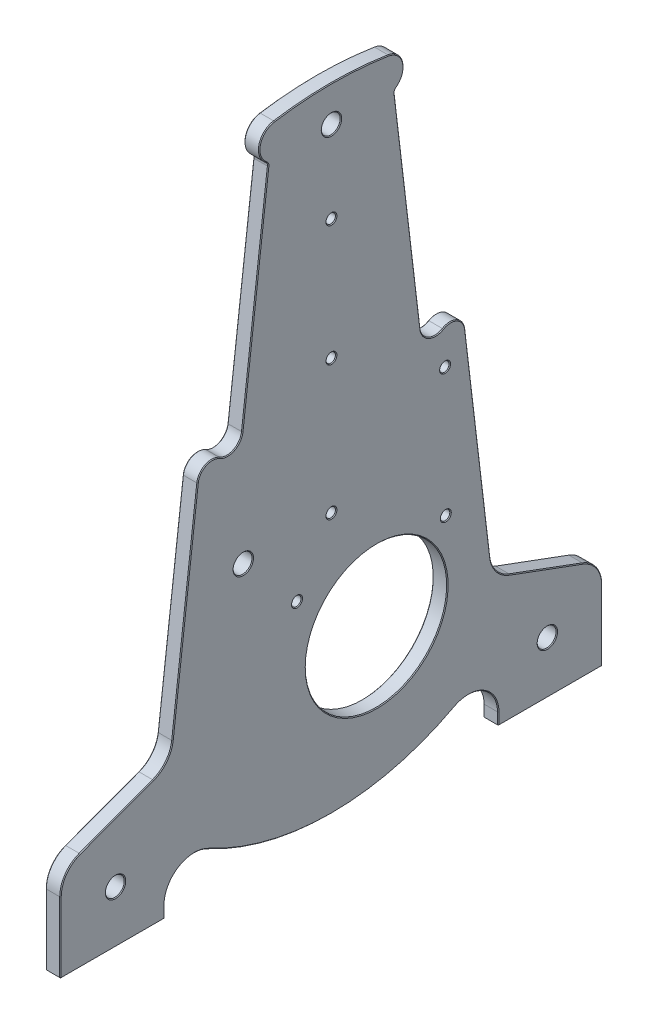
from build123d import *

# Parameters (mm, degrees)
SKETCH_1_R      = 3.175
SKETCH_1_R_2    = 6.35
SKETCH_1_R_3    = 47.5
EXTRUDE_1_DEPTH = 10
FILLET_1_R      = 3
CHAMFER_1_SIZE  = 0.5


with BuildPart() as part:
    # Sketch 1 → Extrude 1 (new body)
    with BuildSketch(Plane(origin=(0, 0, 0), x_dir=(0, 0, -1), z_dir=(1, 0, 0))):
        with BuildLine():
            Line((-42.3, 224.644049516), (-59.901004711, 77.037589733))
            ThreePointArc((-59.901004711, 77.037589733), (-65.396957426, 69.258243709), (-74.915329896, 69.610814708))
            ThreePointArc((-74.915329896, 69.610814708), (-84.433702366, 69.963385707), (-89.929655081, 62.184039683))
            Line((-89.929655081, 62.184039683), (-106.781446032, -79.139324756))
            ThreePointArc((-106.781446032, -79.139324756), (-110.934417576, -89.153124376), (-119.702043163, -95.529024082))
            Line((-119.702043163, -95.529024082), (-168.938713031, -113.742221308))
            ThreePointArc((-168.938713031, -113.742221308), (-178.4130171, -121.071401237), (-182, -132.5))
            Line((-182, -132.5), (-182, -180))
            Line((-182, -180), (-112, -180))
            Line((-112, -180), (-112, -171.933126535))
            ThreePointArc((-112, -171.933126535), (-102.27818202, -154.776233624), (-82.564102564, -154.298959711))
            ThreePointArc((-82.564102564, -154.298959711), (0, -175), (82.564102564, -154.298959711))
            ThreePointArc((82.564102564, -154.298959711), (102.27818202, -154.776233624), (112, -171.933126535))
            Line((112, -171.933126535), (112, -180))
            Line((112, -180), (182, -180))
            Line((182, -180), (182, -132.5))
            ThreePointArc((182, -132.5), (178.4130171, -121.071401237), (168.938713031, -113.742221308))
            Line((168.938713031, -113.742221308), (119.702043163, -95.529024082))
            ThreePointArc((119.702043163, -95.529024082), (110.934417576, -89.153124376), (106.781446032, -79.139324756))
            Line((106.781446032, -79.139324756), (89.929655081, 62.184039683))
            ThreePointArc((89.929655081, 62.184039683), (84.433702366, 69.963385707), (74.915329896, 69.610814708))
            ThreePointArc((74.915329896, 69.610814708), (65.396957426, 69.258243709), (59.901004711, 77.037589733))
            Line((59.901004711, 77.037589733), (42.3, 224.644049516))
            ThreePointArc((42.3, 224.644049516), (48.371365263, 237.239580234), (38.392857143, 247.034387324))
            ThreePointArc((38.392857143, 247.034387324), (0, 250), (-38.392857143, 247.034387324))
            ThreePointArc((-38.392857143, 247.034387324), (-48.371365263, 237.239580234), (-42.3, 224.644049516))
        make_face()
        Circle(SKETCH_1_R, mode=Mode.SUBTRACT)
        with Locations((0, 90)):
            Circle(SKETCH_1_R, mode=Mode.SUBTRACT)
        with Locations((0, 171)):
            Circle(SKETCH_1_R, mode=Mode.SUBTRACT)
        with Locations((0, 226)):
            Circle(SKETCH_1_R_2, mode=Mode.SUBTRACT)
        with Locations((76.32, 46.615260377)):
            Circle(SKETCH_1_R, mode=Mode.SUBTRACT)
        with Locations((76.81, -39.997298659)):
            Circle(SKETCH_1_R, mode=Mode.SUBTRACT)
        with Locations((-145, -145)):
            Circle(SKETCH_1_R_2, mode=Mode.SUBTRACT)
        with Locations(Location((145, -145, 0), (0, 0, 180))):
            Circle(SKETCH_1_R_2, mode=Mode.SUBTRACT)
        with Locations((30.38, -81.096335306)):
            Circle(SKETCH_1_R_3, mode=Mode.SUBTRACT)
        with Locations((-59.2, 0)):
            Circle(SKETCH_1_R_2, mode=Mode.SUBTRACT)
        with Locations((-23.12, -40)):
            Circle(SKETCH_1_R, mode=Mode.SUBTRACT)
    extrude(amount=EXTRUDE_1_DEPTH)

    # Fillet 1
    fillet_1_edges = [part.edges().sort_by_distance(p)[0] for p in [
        (5, 224.644049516, -42.3),
        (5, 224.644049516, 42.3),
    ]]
    fillet(fillet_1_edges, radius=FILLET_1_R)

    # Chamfer 1
    chamfer_1_edges = [part.edges().sort_by_distance(p)[0] for p in [
        (10, 238.059526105, 48.198584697),
        (10, 69.258243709, 65.396957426),
        (0, 238.059526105, -48.198584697),
        (10, 238.059526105, -48.198584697),
        (0, 149.911117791, 51.211362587),
        (10, 149.911117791, 51.211362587),
        (0, 224.325665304, -42.744920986),
        (10, 224.325665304, -42.744920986),
        (0, 224.325665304, 42.744920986),
        (10, 224.325665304, 42.744920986),
        (10, 69.963385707, 84.433702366),
        (10, -8.477642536, 98.355550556),
        (0, 149.911117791, -51.211362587),
        (0, 69.258243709, -65.396957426),
        (0, 69.963385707, -84.433702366),
        (0, -8.477642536, -98.355550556),
        (0, -89.153124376, -110.934417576),
        (0, -104.635622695, -144.320378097),
        (0, -121.071401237, -178.4130171),
        (0, -156.25, -182),
        (10, -89.153124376, 110.934417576),
        (0, -180, -147),
        (0, -175.966563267, -112),
        (0, -154.776233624, -102.27818202),
        (0, -175, 0),
        (0, -154.776233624, 102.27818202),
        (0, -175.966563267, 112),
        (0, -180, 147),
        (10, -104.635622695, 144.320378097),
        (0, -156.25, 182),
        (0, -121.071401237, 178.4130171),
        (0, -104.635622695, 144.320378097),
        (0, -89.153124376, 110.934417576),
        (0, -8.477642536, 98.355550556),
        (0, 69.963385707, 84.433702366),
        (0, 69.258243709, 65.396957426),
        (10, -121.071401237, 178.4130171),
        (0, 238.059526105, 48.198584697),
        (0, 250, 0),
        (10, -156.25, 182),
        (10, -180, 147),
        (10, -175.966563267, 112),
        (5, -180, -182),
        (5, -180, -112),
        (5, -180, 112),
        (5, -180, 182),
        (10, -154.776233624, 102.27818202),
        (10, -175, 0),
        (10, -154.776233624, -102.27818202),
        (10, -175.966563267, -112),
        (10, -180, -147),
        (10, -156.25, -182),
        (0, 0, 3.175),
        (10, 0, 3.175),
        (10, -121.071401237, -178.4130171),
        (10, -104.635622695, -144.320378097),
        (0, 90, 3.175),
        (10, 90, 3.175),
        (10, -89.153124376, -110.934417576),
        (0, 171, 3.175),
        (10, 171, 3.175),
        (10, 250, 0),
        (10, -8.477642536, -98.355550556),
        (0, 226, 6.35),
        (10, 226, 6.35),
        (10, 69.963385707, -84.433702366),
        (0, 46.615260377, -73.145),
        (10, 46.615260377, -73.145),
        (10, 69.258243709, -65.396957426),
        (10, 149.911117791, -51.211362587),
        (0, -39.997298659, -73.635),
        (10, -39.997298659, -73.635),
        (0, -145, 151.35),
        (10, -145, 151.35),
        (0, -145, -151.35),
        (10, -145, -151.35),
        (0, -81.096335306, 17.12),
        (10, -81.096335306, 17.12),
        (0, 0, 65.55),
        (10, 0, 65.55),
        (0, -40, 26.295),
        (10, -40, 26.295),
    ]]
    chamfer(chamfer_1_edges, length=CHAMFER_1_SIZE)


solid = part.part
